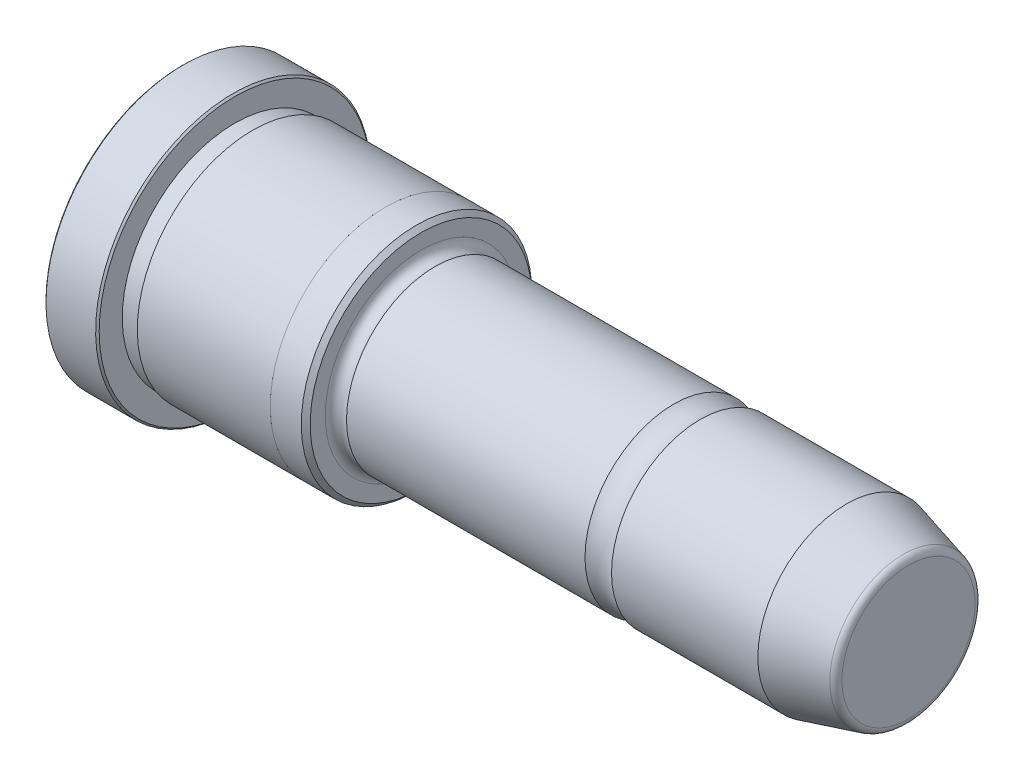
ISO-10303-21;
HEADER;
FILE_DESCRIPTION(('STEP AP214'),'2;1');
FILE_NAME('part.step','',(''),(''),'','','');
FILE_SCHEMA(('AUTOMOTIVE_DESIGN { 1 0 10303 214 1 1 1 1 }'));
ENDSEC;
DATA;
#1=APPLICATION_CONTEXT('core data for automotive mechanical design processes');
#2=APPLICATION_PROTOCOL_DEFINITION('international standard','automotive_design',2000,#1);
#3=PRODUCT_CONTEXT('',#1,'mechanical');
#4=PRODUCT('Part','Part','',(#3));
#5=PRODUCT_RELATED_PRODUCT_CATEGORY('part','',(#4));
#6=PRODUCT_DEFINITION_FORMATION('','',#4);
#7=PRODUCT_DEFINITION_CONTEXT('part definition',#1,'design');
#8=PRODUCT_DEFINITION('design','',#6,#7);
#9=PRODUCT_DEFINITION_SHAPE('','',#8);
#10=(LENGTH_UNIT() NAMED_UNIT(*) SI_UNIT(.MILLI.,.METRE.));
#11=(NAMED_UNIT(*) PLANE_ANGLE_UNIT() SI_UNIT($,.RADIAN.));
#12=(NAMED_UNIT(*) SI_UNIT($,.STERADIAN.) SOLID_ANGLE_UNIT());
#13=UNCERTAINTY_MEASURE_WITH_UNIT(LENGTH_MEASURE(1.E-05),#10,'distance_accuracy_value','');
#14=(GEOMETRIC_REPRESENTATION_CONTEXT(3) GLOBAL_UNCERTAINTY_ASSIGNED_CONTEXT((#13)) GLOBAL_UNIT_ASSIGNED_CONTEXT((#10,
#11,#12)) REPRESENTATION_CONTEXT('',''));
#15=CARTESIAN_POINT('',(0.,0.,0.));
#16=DIRECTION('',(0.,0.,1.));
#17=DIRECTION('',(1.,0.,0.));
#18=AXIS2_PLACEMENT_3D('',#15,#16,#17);
#19=CARTESIAN_POINT('',(55.,0.,0.));
#20=DIRECTION('',(1.,0.,0.));
#21=DIRECTION('',(0.,1.,0.));
#22=AXIS2_PLACEMENT_3D('',#19,#20,#21);
#23=CYLINDRICAL_SURFACE('',#22,9.99999999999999);
#24=CARTESIAN_POINT('',(1.6,0.,0.));
#25=DIRECTION('',(1.,0.,0.));
#26=DIRECTION('',(0.,1.,0.));
#27=AXIS2_PLACEMENT_3D('',#24,#25,#26);
#28=CIRCLE('',#27,9.99999999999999);
#29=CARTESIAN_POINT('',(1.6,10.,0.));
#30=VERTEX_POINT('',#29);
#31=EDGE_CURVE('E63',#30,#30,#28,.T.);
#32=ORIENTED_EDGE('',*,*,#31,.T.);
#33=EDGE_LOOP('',(#32));
#34=FACE_BOUND('',#33,.T.);
#35=CARTESIAN_POINT('',(28.5033370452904,0.,0.));
#36=DIRECTION('',(-1.,0.,0.));
#37=DIRECTION('',(0.,-1.,0.));
#38=AXIS2_PLACEMENT_3D('',#35,#36,#37);
#39=CIRCLE('',#38,9.99999999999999);
#40=CARTESIAN_POINT('',(28.5033370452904,-9.99999999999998,0.));
#41=VERTEX_POINT('',#40);
#42=EDGE_CURVE('E87',#41,#41,#39,.T.);
#43=ORIENTED_EDGE('',*,*,#42,.T.);
#44=EDGE_LOOP('',(#43));
#45=FACE_BOUND('',#44,.T.);
#46=ADVANCED_FACE('F28',(#34,#45),#23,.T.);
#47=CARTESIAN_POINT('',(1.,0.,0.));
#48=DIRECTION('',(1.,0.,0.));
#49=DIRECTION('',(0.,1.,0.));
#50=AXIS2_PLACEMENT_3D('',#47,#48,#49);
#51=TOROIDAL_SURFACE('',#50,10.8,1.);
#52=CARTESIAN_POINT('',(0.,0.,0.));
#53=DIRECTION('',(1.,0.,0.));
#54=DIRECTION('',(0.,1.,0.));
#55=AXIS2_PLACEMENT_3D('',#52,#53,#54);
#56=CIRCLE('',#55,10.8);
#57=CARTESIAN_POINT('',(0.,10.8,0.));
#58=VERTEX_POINT('',#57);
#59=EDGE_CURVE('E66',#58,#58,#56,.T.);
#60=ORIENTED_EDGE('',*,*,#59,.T.);
#61=EDGE_LOOP('',(#60));
#62=FACE_BOUND('',#61,.T.);
#63=ORIENTED_EDGE('',*,*,#31,.F.);
#64=EDGE_LOOP('',(#63));
#65=FACE_BOUND('',#64,.T.);
#66=ADVANCED_FACE('F109',(#62,#65),#51,.F.);
#67=CARTESIAN_POINT('',(0.,10.8,0.));
#68=DIRECTION('',(1.,0.,0.));
#69=DIRECTION('',(0.,1.,0.));
#70=AXIS2_PLACEMENT_3D('',#67,#68,#69);
#71=PLANE('',#70);
#72=CARTESIAN_POINT('',(0.,0.,0.));
#73=DIRECTION('',(1.,0.,0.));
#74=DIRECTION('',(0.,1.,0.));
#75=AXIS2_PLACEMENT_3D('',#72,#73,#74);
#76=CIRCLE('',#75,12.5);
#77=CARTESIAN_POINT('',(0.,12.5,0.));
#78=VERTEX_POINT('',#77);
#79=EDGE_CURVE('E35',#78,#78,#76,.T.);
#80=ORIENTED_EDGE('',*,*,#79,.T.);
#81=EDGE_LOOP('',(#80));
#82=FACE_BOUND('',#81,.T.);
#83=ORIENTED_EDGE('',*,*,#59,.F.);
#84=EDGE_LOOP('',(#83));
#85=FACE_BOUND('',#84,.T.);
#86=ADVANCED_FACE('F116',(#82,#85),#71,.T.);
#87=CARTESIAN_POINT('',(55.,0.,0.));
#88=DIRECTION('',(1.,0.,0.));
#89=DIRECTION('',(0.,1.,0.));
#90=AXIS2_PLACEMENT_3D('',#87,#88,#89);
#91=CYLINDRICAL_SURFACE('',#90,13.);
#92=CARTESIAN_POINT('',(-0.500000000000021,0.,0.));
#93=DIRECTION('',(1.,0.,0.));
#94=DIRECTION('',(0.,1.,0.));
#95=AXIS2_PLACEMENT_3D('',#92,#93,#94);
#96=CIRCLE('',#95,13.);
#97=CARTESIAN_POINT('',(-0.500000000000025,13.,0.));
#98=VERTEX_POINT('',#97);
#99=EDGE_CURVE('E10',#98,#98,#96,.F.);
#100=ORIENTED_EDGE('',*,*,#99,.T.);
#101=EDGE_LOOP('',(#100));
#102=FACE_BOUND('',#101,.T.);
#103=CARTESIAN_POINT('',(-4.,0.,0.));
#104=DIRECTION('',(1.,0.,0.));
#105=DIRECTION('',(0.,1.,0.));
#106=AXIS2_PLACEMENT_3D('',#103,#104,#105);
#107=CIRCLE('',#106,13.);
#108=CARTESIAN_POINT('',(-4.,13.,0.));
#109=VERTEX_POINT('',#108);
#110=EDGE_CURVE('E69',#109,#109,#107,.T.);
#111=ORIENTED_EDGE('',*,*,#110,.T.);
#112=EDGE_LOOP('',(#111));
#113=FACE_BOUND('',#112,.T.);
#114=ADVANCED_FACE('F178',(#102,#113),#91,.T.);
#115=CARTESIAN_POINT('',(-4.,13.001,0.));
#116=DIRECTION('',(1.,0.,0.));
#117=DIRECTION('',(0.,1.,0.));
#118=AXIS2_PLACEMENT_3D('',#115,#116,#117);
#119=PLANE('',#118);
#120=CARTESIAN_POINT('',(-3.99999999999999,0.,0.));
#121=DIRECTION('',(1.,0.,0.));
#122=DIRECTION('',(0.,1.,0.));
#123=AXIS2_PLACEMENT_3D('',#120,#121,#122);
#124=CIRCLE('',#123,13.001);
#125=CARTESIAN_POINT('',(-3.99999999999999,13.001,0.));
#126=VERTEX_POINT('',#125);
#127=EDGE_CURVE('E72',#126,#126,#124,.T.);
#128=ORIENTED_EDGE('',*,*,#127,.T.);
#129=EDGE_LOOP('',(#128));
#130=FACE_BOUND('',#129,.T.);
#131=ORIENTED_EDGE('',*,*,#110,.F.);
#132=EDGE_LOOP('',(#131));
#133=FACE_BOUND('',#132,.T.);
#134=ADVANCED_FACE('F172',(#130,#133),#119,.T.);
#135=CARTESIAN_POINT('',(55.,0.,0.));
#136=DIRECTION('',(1.,0.,0.));
#137=DIRECTION('',(0.,1.,0.));
#138=AXIS2_PLACEMENT_3D('',#135,#136,#137);
#139=CYLINDRICAL_SURFACE('',#138,13.001);
#140=CARTESIAN_POINT('',(-19.,0.,0.));
#141=DIRECTION('',(1.,0.,0.));
#142=DIRECTION('',(0.,1.,0.));
#143=AXIS2_PLACEMENT_3D('',#140,#141,#142);
#144=CIRCLE('',#143,13.001);
#145=CARTESIAN_POINT('',(-19.,13.001,0.));
#146=VERTEX_POINT('',#145);
#147=EDGE_CURVE('E75',#146,#146,#144,.T.);
#148=ORIENTED_EDGE('',*,*,#147,.T.);
#149=EDGE_LOOP('',(#148));
#150=FACE_BOUND('',#149,.T.);
#151=ORIENTED_EDGE('',*,*,#127,.F.);
#152=EDGE_LOOP('',(#151));
#153=FACE_BOUND('',#152,.T.);
#154=ADVANCED_FACE('F166',(#150,#153),#139,.T.);
#155=CARTESIAN_POINT('',(-19.,13.001,0.));
#156=DIRECTION('',(-1.,0.,0.));
#157=DIRECTION('',(0.,-1.,0.));
#158=AXIS2_PLACEMENT_3D('',#155,#156,#157);
#159=PLANE('',#158);
#160=CARTESIAN_POINT('',(-19.,0.,0.));
#161=DIRECTION('',(1.,0.,0.));
#162=DIRECTION('',(0.,1.,0.));
#163=AXIS2_PLACEMENT_3D('',#160,#161,#162);
#164=CIRCLE('',#163,12.7);
#165=CARTESIAN_POINT('',(-19.,12.7,0.));
#166=VERTEX_POINT('',#165);
#167=EDGE_CURVE('E78',#166,#166,#164,.T.);
#168=ORIENTED_EDGE('',*,*,#167,.T.);
#169=EDGE_LOOP('',(#168));
#170=FACE_BOUND('',#169,.T.);
#171=ORIENTED_EDGE('',*,*,#147,.F.);
#172=EDGE_LOOP('',(#171));
#173=FACE_BOUND('',#172,.T.);
#174=ADVANCED_FACE('F160',(#170,#173),#159,.T.);
#175=CARTESIAN_POINT('',(55.,0.,0.));
#176=DIRECTION('',(1.,0.,0.));
#177=DIRECTION('',(0.,1.,0.));
#178=AXIS2_PLACEMENT_3D('',#175,#176,#177);
#179=CYLINDRICAL_SURFACE('',#178,12.7);
#180=CARTESIAN_POINT('',(-21.,0.,0.));
#181=DIRECTION('',(1.,0.,0.));
#182=DIRECTION('',(0.,1.,0.));
#183=AXIS2_PLACEMENT_3D('',#180,#181,#182);
#184=CIRCLE('',#183,12.7);
#185=CARTESIAN_POINT('',(-21.,12.7,0.));
#186=VERTEX_POINT('',#185);
#187=EDGE_CURVE('E81',#186,#186,#184,.T.);
#188=ORIENTED_EDGE('',*,*,#187,.T.);
#189=EDGE_LOOP('',(#188));
#190=FACE_BOUND('',#189,.T.);
#191=ORIENTED_EDGE('',*,*,#167,.F.);
#192=EDGE_LOOP('',(#191));
#193=FACE_BOUND('',#192,.T.);
#194=ADVANCED_FACE('F154',(#190,#193),#179,.T.);
#195=CARTESIAN_POINT('',(-21.,12.7,0.));
#196=DIRECTION('',(1.,0.,0.));
#197=DIRECTION('',(0.,1.,0.));
#198=AXIS2_PLACEMENT_3D('',#195,#196,#197);
#199=PLANE('',#198);
#200=CARTESIAN_POINT('',(-21.,0.,0.));
#201=DIRECTION('',(1.,0.,0.));
#202=DIRECTION('',(0.,1.,0.));
#203=AXIS2_PLACEMENT_3D('',#200,#201,#202);
#204=CIRCLE('',#203,15.3);
#205=CARTESIAN_POINT('',(-21.,-15.3,0.));
#206=VERTEX_POINT('',#205);
#207=EDGE_CURVE('E39',#206,#206,#204,.T.);
#208=ORIENTED_EDGE('',*,*,#207,.T.);
#209=EDGE_LOOP('',(#208));
#210=FACE_BOUND('',#209,.T.);
#211=ORIENTED_EDGE('',*,*,#187,.F.);
#212=EDGE_LOOP('',(#211));
#213=FACE_BOUND('',#212,.T.);
#214=ADVANCED_FACE('F151',(#210,#213),#199,.T.);
#215=CARTESIAN_POINT('',(55.,0.,0.));
#216=DIRECTION('',(1.,0.,0.));
#217=DIRECTION('',(0.,1.,0.));
#218=AXIS2_PLACEMENT_3D('',#215,#216,#217);
#219=CYLINDRICAL_SURFACE('',#218,15.5);
#220=CARTESIAN_POINT('',(-26.8,0.,0.));
#221=DIRECTION('',(-1.,0.,0.));
#222=DIRECTION('',(0.,-1.,0.));
#223=AXIS2_PLACEMENT_3D('',#220,#221,#222);
#224=CIRCLE('',#223,15.5);
#225=CARTESIAN_POINT('',(-26.8,-15.5,0.));
#226=VERTEX_POINT('',#225);
#227=EDGE_CURVE('E48',#226,#226,#224,.F.);
#228=ORIENTED_EDGE('',*,*,#227,.T.);
#229=EDGE_LOOP('',(#228));
#230=FACE_BOUND('',#229,.T.);
#231=CARTESIAN_POINT('',(-21.2,0.,0.));
#232=DIRECTION('',(1.,0.,0.));
#233=DIRECTION('',(0.,1.,0.));
#234=AXIS2_PLACEMENT_3D('',#231,#232,#233);
#235=CIRCLE('',#234,15.5);
#236=CARTESIAN_POINT('',(-21.2,-15.5,0.));
#237=VERTEX_POINT('',#236);
#238=EDGE_CURVE('E51',#237,#237,#235,.F.);
#239=ORIENTED_EDGE('',*,*,#238,.T.);
#240=EDGE_LOOP('',(#239));
#241=FACE_BOUND('',#240,.T.);
#242=ADVANCED_FACE('F105',(#230,#241),#219,.T.);
#243=CARTESIAN_POINT('',(-27.,15.5,0.));
#244=DIRECTION('',(-1.,0.,0.));
#245=DIRECTION('',(0.,-1.,0.));
#246=AXIS2_PLACEMENT_3D('',#243,#244,#245);
#247=PLANE('',#246);
#248=CARTESIAN_POINT('',(-27.,0.,0.));
#249=DIRECTION('',(-1.,0.,0.));
#250=DIRECTION('',(0.,-1.,0.));
#251=AXIS2_PLACEMENT_3D('',#248,#249,#250);
#252=CIRCLE('',#251,15.3);
#253=CARTESIAN_POINT('',(-27.,-15.3,0.));
#254=VERTEX_POINT('',#253);
#255=EDGE_CURVE('E43',#254,#254,#252,.T.);
#256=ORIENTED_EDGE('',*,*,#255,.T.);
#257=EDGE_LOOP('',(#256));
#258=FACE_BOUND('',#257,.T.);
#259=ADVANCED_FACE('F95',(#258),#247,.T.);
#260=CARTESIAN_POINT('',(30.,0.,0.));
#261=DIRECTION('',(-1.,0.,0.));
#262=DIRECTION('',(0.,-1.,0.));
#263=AXIS2_PLACEMENT_3D('',#260,#261,#262);
#264=TOROIDAL_SURFACE('',#263,12.6,3.);
#265=CARTESIAN_POINT('',(31.4966629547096,0.,0.));
#266=DIRECTION('',(-1.,0.,0.));
#267=DIRECTION('',(0.,-1.,0.));
#268=AXIS2_PLACEMENT_3D('',#265,#266,#267);
#269=CIRCLE('',#268,9.99999999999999);
#270=CARTESIAN_POINT('',(31.4966629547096,-9.99999999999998,0.));
#271=VERTEX_POINT('',#270);
#272=EDGE_CURVE('E84',#271,#271,#269,.T.);
#273=ORIENTED_EDGE('',*,*,#272,.T.);
#274=EDGE_LOOP('',(#273));
#275=FACE_BOUND('',#274,.T.);
#276=ORIENTED_EDGE('',*,*,#42,.F.);
#277=EDGE_LOOP('',(#276));
#278=FACE_BOUND('',#277,.T.);
#279=ADVANCED_FACE('F92',(#275,#278),#264,.F.);
#280=CARTESIAN_POINT('',(55.,8.12435565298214,0.));
#281=DIRECTION('',(1.,0.,0.));
#282=DIRECTION('',(0.,1.,0.));
#283=AXIS2_PLACEMENT_3D('',#280,#281,#282);
#284=PLANE('',#283);
#285=CARTESIAN_POINT('',(55.,0.,0.));
#286=DIRECTION('',(1.,0.,0.));
#287=DIRECTION('',(0.,1.,0.));
#288=AXIS2_PLACEMENT_3D('',#285,#286,#287);
#289=CIRCLE('',#288,7.51049406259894);
#290=CARTESIAN_POINT('',(55.,7.51049406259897,0.));
#291=VERTEX_POINT('',#290);
#292=EDGE_CURVE('E57',#291,#291,#289,.T.);
#293=ORIENTED_EDGE('',*,*,#292,.T.);
#294=EDGE_LOOP('',(#293));
#295=FACE_BOUND('',#294,.T.);
#296=ADVANCED_FACE('F94',(#295),#284,.T.);
#297=CARTESIAN_POINT('',(55.,0.,0.));
#298=DIRECTION('',(-1.,0.,0.));
#299=DIRECTION('',(0.,-1.,0.));
#300=AXIS2_PLACEMENT_3D('',#297,#298,#299);
#301=CONICAL_SURFACE('',#300,8.12435565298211,0.26179938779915);
#302=CARTESIAN_POINT('',(54.407055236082,0.,0.));
#303=DIRECTION('',(1.,0.,0.));
#304=DIRECTION('',(0.,1.,0.));
#305=AXIS2_PLACEMENT_3D('',#302,#303,#304);
#306=CIRCLE('',#305,8.2832347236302);
#307=CARTESIAN_POINT('',(54.407055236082,8.28323472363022,0.));
#308=VERTEX_POINT('',#307);
#309=EDGE_CURVE('E54',#308,#308,#306,.F.);
#310=ORIENTED_EDGE('',*,*,#309,.T.);
#311=EDGE_LOOP('',(#310));
#312=FACE_BOUND('',#311,.T.);
#313=CARTESIAN_POINT('',(48.,0.,0.));
#314=DIRECTION('',(1.,0.,0.));
#315=DIRECTION('',(0.,1.,0.));
#316=AXIS2_PLACEMENT_3D('',#313,#314,#315);
#317=CIRCLE('',#316,9.99999999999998);
#318=CARTESIAN_POINT('',(48.,10.,0.));
#319=VERTEX_POINT('',#318);
#320=EDGE_CURVE('E60',#319,#319,#317,.T.);
#321=ORIENTED_EDGE('',*,*,#320,.T.);
#322=EDGE_LOOP('',(#321));
#323=FACE_BOUND('',#322,.T.);
#324=ADVANCED_FACE('F102',(#312,#323),#301,.T.);
#325=ORIENTED_EDGE('',*,*,#320,.F.);
#326=EDGE_LOOP('',(#325));
#327=FACE_BOUND('',#326,.T.);
#328=ORIENTED_EDGE('',*,*,#272,.F.);
#329=EDGE_LOOP('',(#328));
#330=FACE_BOUND('',#329,.T.);
#331=ADVANCED_FACE('F112',(#327,#330),#23,.T.);
#332=CARTESIAN_POINT('',(54.2,0.,0.));
#333=DIRECTION('',(1.,0.,0.));
#334=DIRECTION('',(0.,1.,0.));
#335=AXIS2_PLACEMENT_3D('',#332,#333,#334);
#336=TOROIDAL_SURFACE('',#335,7.51049406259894,0.8);
#337=ORIENTED_EDGE('',*,*,#309,.F.);
#338=EDGE_LOOP('',(#337));
#339=FACE_BOUND('',#338,.T.);
#340=ORIENTED_EDGE('',*,*,#292,.F.);
#341=EDGE_LOOP('',(#340));
#342=FACE_BOUND('',#341,.T.);
#343=ADVANCED_FACE('F121',(#339,#342),#336,.T.);
#344=CARTESIAN_POINT('',(-26.8,0.,0.));
#345=DIRECTION('',(1.,0.,0.));
#346=DIRECTION('',(0.,1.,0.));
#347=AXIS2_PLACEMENT_3D('',#344,#345,#346);
#348=CONICAL_SURFACE('',#347,15.5,0.785398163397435);
#349=ORIENTED_EDGE('',*,*,#255,.F.);
#350=EDGE_LOOP('',(#349));
#351=FACE_BOUND('',#350,.T.);
#352=ORIENTED_EDGE('',*,*,#227,.F.);
#353=EDGE_LOOP('',(#352));
#354=FACE_BOUND('',#353,.T.);
#355=ADVANCED_FACE('F127',(#351,#354),#348,.T.);
#356=CARTESIAN_POINT('',(-21.,0.,0.));
#357=DIRECTION('',(-1.,0.,0.));
#358=DIRECTION('',(0.,-1.,0.));
#359=AXIS2_PLACEMENT_3D('',#356,#357,#358);
#360=CONICAL_SURFACE('',#359,15.3,0.785398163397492);
#361=CARTESIAN_POINT('',(-21.2,-15.5,0.));
#362=CARTESIAN_POINT('',(-21.1979166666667,-15.4979166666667,0.));
#363=CARTESIAN_POINT('',(-21.1958333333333,-15.4958333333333,0.));
#364=CARTESIAN_POINT('',(-21.1916666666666,-15.4916666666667,0.));
#365=CARTESIAN_POINT('',(-21.1895833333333,-15.4895833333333,0.));
#366=CARTESIAN_POINT('',(-21.1854166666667,-15.4854166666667,0.));
#367=CARTESIAN_POINT('',(-21.1833333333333,-15.4833333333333,0.));
#368=CARTESIAN_POINT('',(-21.1791666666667,-15.4791666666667,0.));
#369=CARTESIAN_POINT('',(-21.1770833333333,-15.4770833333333,0.));
#370=CARTESIAN_POINT('',(-21.1729166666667,-15.4729166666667,0.));
#371=CARTESIAN_POINT('',(-21.1708333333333,-15.4708333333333,0.));
#372=CARTESIAN_POINT('',(-21.1666666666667,-15.4666666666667,0.));
#373=CARTESIAN_POINT('',(-21.1645833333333,-15.4645833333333,0.));
#374=CARTESIAN_POINT('',(-21.1604166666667,-15.4604166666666,0.));
#375=CARTESIAN_POINT('',(-21.1583333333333,-15.4583333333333,0.));
#376=CARTESIAN_POINT('',(-21.1541666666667,-15.4541666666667,0.));
#377=CARTESIAN_POINT('',(-21.1520833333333,-15.4520833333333,0.));
#378=CARTESIAN_POINT('',(-21.1479166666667,-15.4479166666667,0.));
#379=CARTESIAN_POINT('',(-21.1458333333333,-15.4458333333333,0.));
#380=CARTESIAN_POINT('',(-21.1416666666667,-15.4416666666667,0.));
#381=CARTESIAN_POINT('',(-21.1395833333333,-15.4395833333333,0.));
#382=CARTESIAN_POINT('',(-21.1354166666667,-15.4354166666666,0.));
#383=CARTESIAN_POINT('',(-21.1333333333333,-15.4333333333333,0.));
#384=CARTESIAN_POINT('',(-21.1291666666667,-15.4291666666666,0.));
#385=CARTESIAN_POINT('',(-21.1270833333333,-15.4270833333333,0.));
#386=CARTESIAN_POINT('',(-21.1229166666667,-15.4229166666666,0.));
#387=CARTESIAN_POINT('',(-21.1208333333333,-15.4208333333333,0.));
#388=CARTESIAN_POINT('',(-21.1166666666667,-15.4166666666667,0.));
#389=CARTESIAN_POINT('',(-21.1145833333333,-15.4145833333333,0.));
#390=CARTESIAN_POINT('',(-21.1104166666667,-15.4104166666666,0.));
#391=CARTESIAN_POINT('',(-21.1083333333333,-15.4083333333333,0.));
#392=CARTESIAN_POINT('',(-21.1041666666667,-15.4041666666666,0.));
#393=CARTESIAN_POINT('',(-21.1020833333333,-15.4020833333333,0.));
#394=CARTESIAN_POINT('',(-21.0979166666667,-15.3979166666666,0.));
#395=CARTESIAN_POINT('',(-21.0958333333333,-15.3958333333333,0.));
#396=CARTESIAN_POINT('',(-21.0916666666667,-15.3916666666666,0.));
#397=CARTESIAN_POINT('',(-21.0895833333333,-15.3895833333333,0.));
#398=CARTESIAN_POINT('',(-21.0854166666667,-15.3854166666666,0.));
#399=CARTESIAN_POINT('',(-21.0833333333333,-15.3833333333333,0.));
#400=CARTESIAN_POINT('',(-21.0791666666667,-15.3791666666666,0.));
#401=CARTESIAN_POINT('',(-21.0770833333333,-15.3770833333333,0.));
#402=CARTESIAN_POINT('',(-21.0729166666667,-15.3729166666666,0.));
#403=CARTESIAN_POINT('',(-21.0708333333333,-15.3708333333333,0.));
#404=CARTESIAN_POINT('',(-21.0666666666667,-15.3666666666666,0.));
#405=CARTESIAN_POINT('',(-21.0645833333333,-15.3645833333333,0.));
#406=CARTESIAN_POINT('',(-21.0604166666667,-15.3604166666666,0.));
#407=CARTESIAN_POINT('',(-21.0583333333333,-15.3583333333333,0.));
#408=CARTESIAN_POINT('',(-21.0541666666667,-15.3541666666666,0.));
#409=CARTESIAN_POINT('',(-21.0520833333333,-15.3520833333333,0.));
#410=CARTESIAN_POINT('',(-21.0479166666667,-15.3479166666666,0.));
#411=CARTESIAN_POINT('',(-21.0458333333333,-15.3458333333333,0.));
#412=CARTESIAN_POINT('',(-21.0416666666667,-15.3416666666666,0.));
#413=CARTESIAN_POINT('',(-21.0395833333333,-15.3395833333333,0.));
#414=CARTESIAN_POINT('',(-21.0354166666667,-15.3354166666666,0.));
#415=CARTESIAN_POINT('',(-21.0333333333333,-15.3333333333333,0.));
#416=CARTESIAN_POINT('',(-21.0291666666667,-15.3291666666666,0.));
#417=CARTESIAN_POINT('',(-21.0270833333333,-15.3270833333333,0.));
#418=CARTESIAN_POINT('',(-21.0229166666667,-15.3229166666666,0.));
#419=CARTESIAN_POINT('',(-21.0208333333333,-15.3208333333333,0.));
#420=CARTESIAN_POINT('',(-21.0166666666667,-15.3166666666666,0.));
#421=CARTESIAN_POINT('',(-21.0145833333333,-15.3145833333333,0.));
#422=CARTESIAN_POINT('',(-21.0104166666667,-15.3104166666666,0.));
#423=CARTESIAN_POINT('',(-21.0083333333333,-15.3083333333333,0.));
#424=CARTESIAN_POINT('',(-21.0041666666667,-15.3041666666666,0.));
#425=CARTESIAN_POINT('',(-21.0020833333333,-15.3020833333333,0.));
#426=CARTESIAN_POINT('',(-21.,-15.3,0.));
#427=B_SPLINE_CURVE_WITH_KNOTS('',3,(#361,#362,#363,#364,#365,#366,#367,#368,#369,#370,#371,
#372,#373,#374,#375,#376,#377,#378,#379,#380,#381,#382,#383,#384,#385,#386,#387,#388,#389,#390,
#391,#392,#393,#394,#395,#396,#397,#398,#399,#400,#401,#402,#403,#404,#405,#406,#407,#408,#409,
#410,#411,#412,#413,#414,#415,#416,#417,#418,#419,#420,#421,#422,#423,#424,#425,#426),
.UNSPECIFIED.,.F.,.F.,(4,2,2,2,2,2,2,2,2,2,2,2,2,2,2,2,2,2,2,2,2,2,2,2,2,2,2,2,2,2,2,2,4),(0.,
0.00883883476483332,0.0176776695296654,0.0265165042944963,0.0353553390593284,0.0441941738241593,
0.0530330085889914,0.0618718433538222,0.0707106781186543,0.0795495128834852,0.0883883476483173,
0.0972271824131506,0.106066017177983,0.114904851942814,0.123743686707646,0.132582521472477,
0.141421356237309,0.15026019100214,0.159099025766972,0.167937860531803,0.176776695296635,
0.185615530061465,0.1944543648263,0.203293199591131,0.212132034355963,0.220970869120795,
0.229809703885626,0.238648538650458,0.247487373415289,0.256326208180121,0.265165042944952,
0.274003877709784,0.282842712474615),.UNSPECIFIED.);
#428=EDGE_CURVE('BSEAM139',#237,#206,#427,.T.);
#429=ORIENTED_EDGE('',*,*,#238,.F.);
#430=ORIENTED_EDGE('',*,*,#207,.F.);
#431=ORIENTED_EDGE('',*,*,#428,.T.);
#432=ORIENTED_EDGE('',*,*,#428,.F.);
#433=EDGE_LOOP('',(#429,#431,#430,#432));
#434=FACE_BOUND('',#433,.T.);
#435=ADVANCED_FACE('F139',(#434),#360,.T.);
#436=CARTESIAN_POINT('',(0.,0.,0.));
#437=DIRECTION('',(-1.,0.,0.));
#438=DIRECTION('',(0.,-1.,0.));
#439=AXIS2_PLACEMENT_3D('',#436,#437,#438);
#440=CONICAL_SURFACE('',#439,12.5,0.785398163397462);
#441=ORIENTED_EDGE('',*,*,#99,.F.);
#442=EDGE_LOOP('',(#441));
#443=FACE_BOUND('',#442,.T.);
#444=ORIENTED_EDGE('',*,*,#79,.F.);
#445=EDGE_LOOP('',(#444));
#446=FACE_BOUND('',#445,.T.);
#447=ADVANCED_FACE('F30',(#443,#446),#440,.T.);
#448=CLOSED_SHELL('',(#46,#66,#86,#114,#134,#154,#174,#194,#214,#242,#259,#279,#296,#324,#331,
#343,#355,#435,#447));
#449=MANIFOLD_SOLID_BREP('B2',#448);
#450=ADVANCED_BREP_SHAPE_REPRESENTATION('',(#18,#449),#14);
#451=SHAPE_DEFINITION_REPRESENTATION(#9,#450);
ENDSEC;
END-ISO-10303-21;
